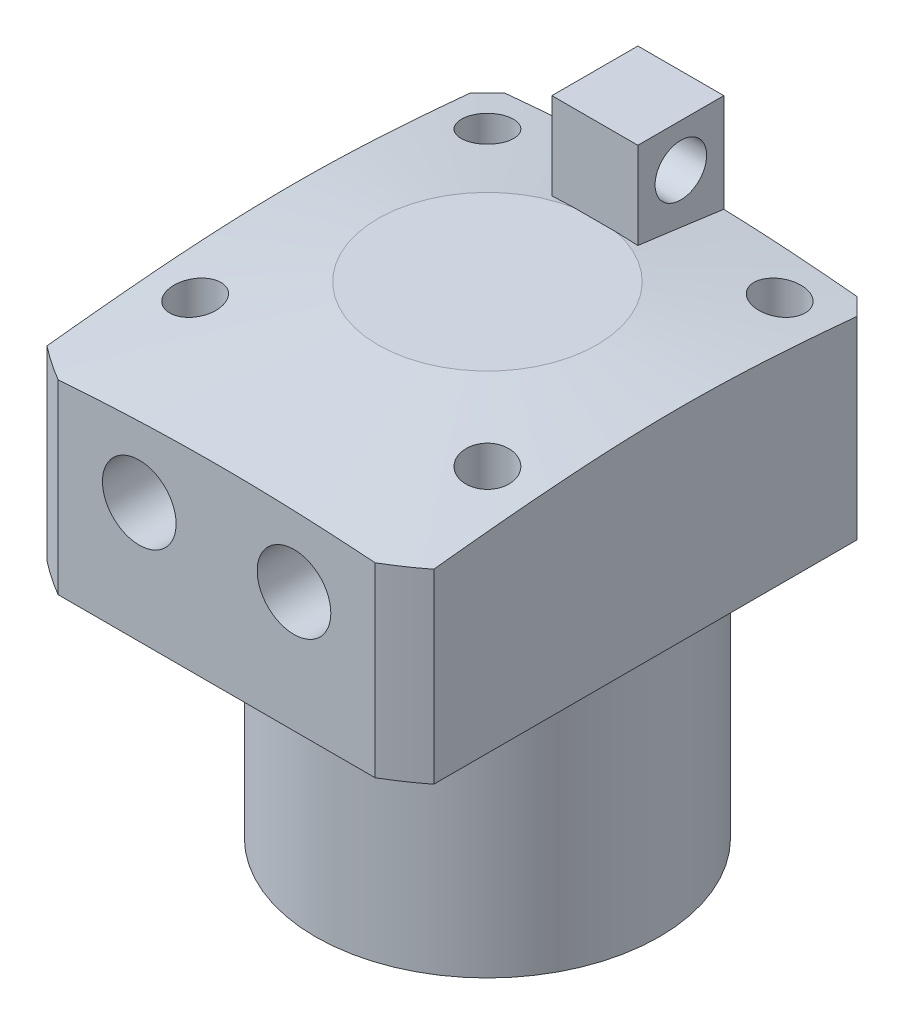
from build123d import *

# Parameters (mm, degrees)
SKETCH2_OUTSIDE_W               = 98.49
SKETCH2_OUTSIDE_H               = 98.49
SKETCH2_OUTSIDE_W_2             = 45
SKETCH2_OUTSIDE_H_2             = 54
CUT_EXTRUDE2_DEPTH              = 77.161013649
CHAMFER1_SIZE                   = 2
G1_8_TAPPED_HOLE1_D             = 8.566
G1_8_TAPPED_HOLE1_DEPTH         = 22.18
F_5_5_5_5_DIAMETER_HOLE1_D      = 5.5
F_5_5_5_5_DIAMETER_HOLE1_DEPTH  = 31.5
F_8_0_8_DIAMETER_HOLE2_D        = 8
F_8_0_8_DIAMETER_HOLE2_DEPTH    = 1.5
F_8_0_8_DIAMETER_HOLE2_TIP      = 2.403442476
SKETCH13_W                      = 10
SKETCH13_H                      = 10
BOSS_EXTRUDE1_DEPTH             = 10
BOSS_EXTRUDE1_DIRECTION_2_REACH = 70.077
F_6_0_6_DIAMETER_HOLE1_D        = 6
F_6_0_6_DIAMETER_HOLE1_DEPTH    = 31.5


with BuildPart() as part:
    # Sketch1 → Revolve1 (revolve)
    with BuildSketch(Plane.XY, mode=Mode.PRIVATE) as revolve1_sk:
        Polygon((0, 0), (-20, 0), (-20, 31), (-36.5, 31), (-36.5, 52.659712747), (-12.732621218, 56), (0, 56), align=None)
    revolve(revolve1_sk.sketch.rotate(Axis((0, 87.050829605, 0), (0, -1, 0)), 270), axis=Axis((0, 87.050829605, 0), (0, -1, 0)))

    # Sketch2 outside → Cut-Extrude2 (cut, through all)
    with BuildSketch(Plane(origin=(0, 56, 0), x_dir=(1, 0, 0), z_dir=(0, 1, 0))):
        Rectangle(SKETCH2_OUTSIDE_W, SKETCH2_OUTSIDE_H)
        with Locations((0, -4.5)):
            Rectangle(SKETCH2_OUTSIDE_W_2, SKETCH2_OUTSIDE_H_2, mode=Mode.SUBTRACT)
    extrude(amount=-CUT_EXTRUDE2_DEPTH, mode=Mode.SUBTRACT)

    # Chamfer1
    chamfer1_edges = [part.edges().sort_by_distance(p)[0] for p in [
        (22.5, 42.158735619, -22.5),
        (-22.5, 42.158735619, -22.5),
    ]]
    chamfer(chamfer1_edges, length=CHAMFER1_SIZE)

    # G1_8 Tapped Hole1
    with Locations(Plane.XY.offset(31.5)):
        with Locations((-9, 45), (9, 45)):
            Hole(G1_8_TAPPED_HOLE1_D / 2, depth=G1_8_TAPPED_HOLE1_DEPTH)

    # 5.5 _5.5_ Diameter Hole1
    with Locations(Plane(origin=(-33.253495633, 31, 49.252389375), x_dir=(-1, 0, 0), z_dir=(0, -1, 0))):
        with Locations((-16.253495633, 66.252389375), (-50.253495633, 66.252389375), (-50.253495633, 32.252389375), (-16.253495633, 32.252389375)):
            Hole(F_5_5_5_5_DIAMETER_HOLE1_D / 2, depth=F_5_5_5_5_DIAMETER_HOLE1_DEPTH)

    # 8.0 _8_ Diameter Hole2
    with Locations(Plane.XZ.offset(-31)):
        with Locations((-9, 26), (9, 26)):
            Hole(F_8_0_8_DIAMETER_HOLE2_D / 2, depth=F_8_0_8_DIAMETER_HOLE2_DEPTH)
            with Locations((0, 0, -(F_8_0_8_DIAMETER_HOLE2_DEPTH + F_8_0_8_DIAMETER_HOLE2_TIP / 2))):  # 118° drill point
                Cone(0, F_8_0_8_DIAMETER_HOLE2_D / 2, F_8_0_8_DIAMETER_HOLE2_TIP, mode=Mode.SUBTRACT)

    # Sketch13 → Boss-Extrude1 (add)
    with BuildSketch(Plane(origin=(0, 56, 0), x_dir=(1, 0, 0), z_dir=(0, 1, 0))):
        with Locations((0, 17.5)):
            Rectangle(SKETCH13_W, SKETCH13_H)
    extrude(amount=BOSS_EXTRUDE1_DEPTH)

    # Boss-Extrude1 direction 2: up to this cone (the profile starts outside it)
    boss_extrude1_direction_2_end = Plane(origin=(0, 56, 0), z_dir=(0, -1, 0)).offset(-1.789452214) * Cone(7.115e-06, 605.511377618, 85.099073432, align=(Align.CENTER, Align.CENTER, Align.MIN), mode=Mode.PRIVATE)
    # Sketch13 → Boss-Extrude1 direction 2 (add, up to the surface)
    with BuildSketch(Plane(origin=(0, 56, 0), x_dir=(1, 0, 0), z_dir=(0, 1, 0)), mode=Mode.PRIVATE) as boss_extrude1_direction_2_sk1:
        with Locations((0, 17.5)):
            Rectangle(SKETCH13_W, SKETCH13_H)
    boss_extrude1_direction_2_tool1 = extrude(boss_extrude1_direction_2_sk1.sketch, amount=-BOSS_EXTRUDE1_DIRECTION_2_REACH, mode=Mode.PRIVATE) - boss_extrude1_direction_2_end
    add(boss_extrude1_direction_2_tool1.solids().sort_by_distance((0, 56, -17.5))[0])

    # 6.0 _6_ Diameter Hole1
    with Locations(Plane(origin=(5, 0, 0), x_dir=(0, 0, -1), z_dir=(1, 0, 0))):
        with Locations((17.5, 61)):
            Hole(F_6_0_6_DIAMETER_HOLE1_D / 2, depth=F_6_0_6_DIAMETER_HOLE1_DEPTH)


solid = part.part
